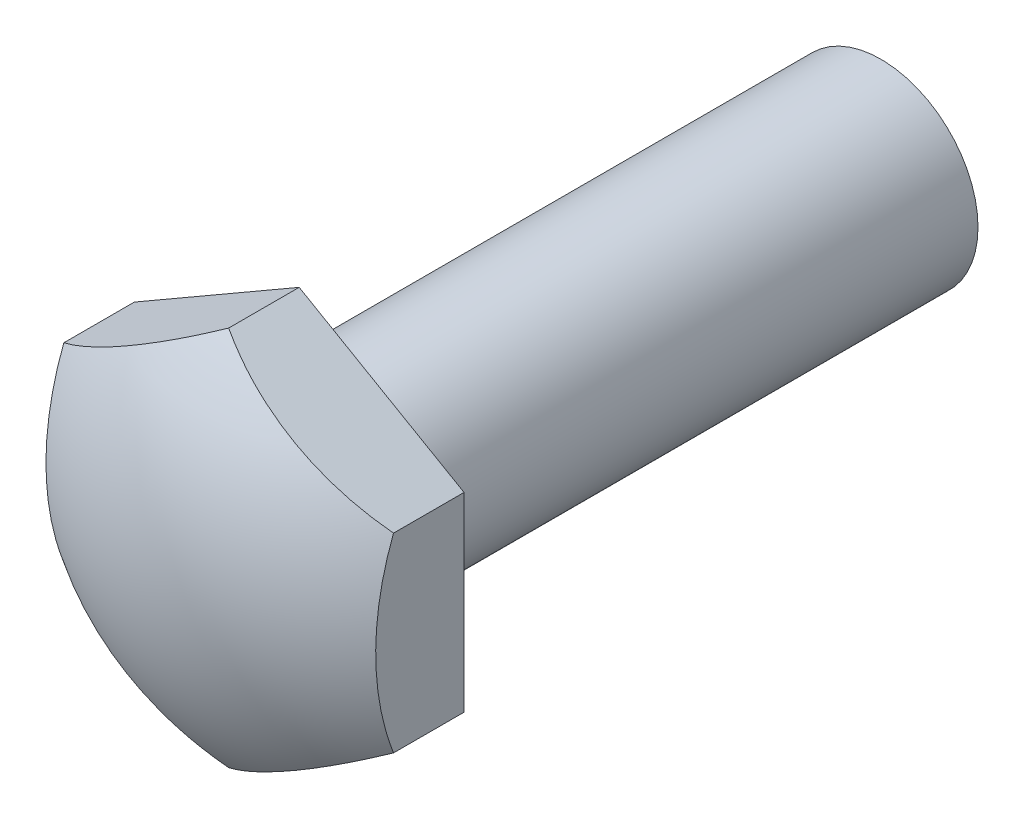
ISO-10303-21;
HEADER;
FILE_DESCRIPTION(('STEP AP214'),'2;1');
FILE_NAME('part.step','',(''),(''),'','','');
FILE_SCHEMA(('AUTOMOTIVE_DESIGN { 1 0 10303 214 1 1 1 1 }'));
ENDSEC;
DATA;
#1=APPLICATION_CONTEXT('core data for automotive mechanical design processes');
#2=APPLICATION_PROTOCOL_DEFINITION('international standard','automotive_design',2000,#1);
#3=PRODUCT_CONTEXT('',#1,'mechanical');
#4=PRODUCT('Part','Part','',(#3));
#5=PRODUCT_RELATED_PRODUCT_CATEGORY('part','',(#4));
#6=PRODUCT_DEFINITION_FORMATION('','',#4);
#7=PRODUCT_DEFINITION_CONTEXT('part definition',#1,'design');
#8=PRODUCT_DEFINITION('design','',#6,#7);
#9=PRODUCT_DEFINITION_SHAPE('','',#8);
#10=(LENGTH_UNIT() NAMED_UNIT(*) SI_UNIT(.MILLI.,.METRE.));
#11=(NAMED_UNIT(*) PLANE_ANGLE_UNIT() SI_UNIT($,.RADIAN.));
#12=(NAMED_UNIT(*) SI_UNIT($,.STERADIAN.) SOLID_ANGLE_UNIT());
#13=UNCERTAINTY_MEASURE_WITH_UNIT(LENGTH_MEASURE(1.E-05),#10,'distance_accuracy_value','');
#14=(GEOMETRIC_REPRESENTATION_CONTEXT(3) GLOBAL_UNCERTAINTY_ASSIGNED_CONTEXT((#13)) GLOBAL_UNIT_ASSIGNED_CONTEXT((#10,
#11,#12)) REPRESENTATION_CONTEXT('',''));
#15=CARTESIAN_POINT('',(0.,0.,0.));
#16=DIRECTION('',(0.,0.,1.));
#17=DIRECTION('',(1.,0.,0.));
#18=AXIS2_PLACEMENT_3D('',#15,#16,#17);
#19=CARTESIAN_POINT('',(0.,0.,-9.));
#20=DIRECTION('',(0.,-1.,0.));
#21=DIRECTION('',(0.,0.,-1.));
#22=AXIS2_PLACEMENT_3D('',#19,#20,#21);
#23=SPHERICAL_SURFACE('',#22,16.);
#24=CARTESIAN_POINT('',(8.5,-4.90747728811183,3.63592761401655));
#25=CARTESIAN_POINT('',(8.29503436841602,-5.02581425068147,3.72785445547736));
#26=CARTESIAN_POINT('',(8.08782796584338,-5.1454449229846,3.8131166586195));
#27=CARTESIAN_POINT('',(7.66959841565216,-5.38690986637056,3.9700758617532));
#28=CARTESIAN_POINT('',(7.45857529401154,-5.508744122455,4.04177295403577));
#29=CARTESIAN_POINT('',(7.03337332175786,-5.75423459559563,4.17136756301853));
#30=CARTESIAN_POINT('',(6.81919445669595,-5.87789082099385,4.22926501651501));
#31=CARTESIAN_POINT('',(6.38806811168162,-6.12680173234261,4.33114861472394));
#32=CARTESIAN_POINT('',(6.17111727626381,-6.252058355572,4.37511582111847));
#33=CARTESIAN_POINT('',(5.73542067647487,-6.50360790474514,4.44889081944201));
#34=CARTESIAN_POINT('',(5.51667496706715,-6.62990079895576,4.47869904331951));
#35=CARTESIAN_POINT('',(5.07810169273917,-6.88311119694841,4.52406404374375));
#36=CARTESIAN_POINT('',(4.85827417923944,-7.01002867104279,4.53962149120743));
#37=CARTESIAN_POINT('',(4.30797766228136,-7.32774251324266,4.56064246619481));
#38=CARTESIAN_POINT('',(3.9772208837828,-7.51870502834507,4.55715181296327));
#39=CARTESIAN_POINT('',(3.31712733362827,-7.8998102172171,4.51796354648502));
#40=CARTESIAN_POINT('',(2.98779073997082,-8.08995278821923,4.48226200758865));
#41=CARTESIAN_POINT('',(2.33368464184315,-8.46760112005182,4.37903559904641));
#42=CARTESIAN_POINT('',(2.00890613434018,-8.65511207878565,4.3115866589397));
#43=CARTESIAN_POINT('',(1.36555876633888,-9.02654885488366,4.14539452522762));
#44=CARTESIAN_POINT('',(1.04698637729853,-9.21047670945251,4.04666969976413));
#45=CARTESIAN_POINT('',(0.609111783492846,-9.46328372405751,3.88788705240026));
#46=CARTESIAN_POINT('',(0.48621526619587,-9.53423806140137,3.84072693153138));
#47=CARTESIAN_POINT('',(0.241960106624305,-9.67525884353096,3.74178641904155));
#48=CARTESIAN_POINT('',(0.120600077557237,-9.7453260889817,3.69001059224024));
#49=CARTESIAN_POINT('',(0.,-9.8149545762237,3.63592761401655));
#50=B_SPLINE_CURVE_WITH_KNOTS('',3,(#24,#25,#26,#27,#28,#29,#30,#31,#32,#33,#34,#35,#36,#37,#38,
#39,#40,#41,#42,#43,#44,#45,#46,#47,#48,#49),.UNSPECIFIED.,.F.,.F.,(4,2,2,2,2,2,2,2,2,2,2,2,4),
(0.,0.761597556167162,1.5231899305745,2.28478579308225,3.04741265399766,3.8100162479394,
4.57258393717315,5.71696615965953,6.8614878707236,8.00328605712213,9.1444149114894,
9.59296979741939,10.0410858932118),.UNSPECIFIED.);
#51=CARTESIAN_POINT('',(8.5,-4.90747728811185,3.63592761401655));
#52=VERTEX_POINT('',#51);
#53=CARTESIAN_POINT('',(0.,-9.81495457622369,3.63592761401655));
#54=VERTEX_POINT('',#53);
#55=EDGE_CURVE('E76',#52,#54,#50,.T.);
#56=ORIENTED_EDGE('',*,*,#55,.F.);
#57=CARTESIAN_POINT('',(8.5,4.90747728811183,3.63592761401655));
#58=CARTESIAN_POINT('',(8.5,4.67080336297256,3.72785445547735));
#59=CARTESIAN_POINT('',(8.5,4.4315420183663,3.8131166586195));
#60=CARTESIAN_POINT('',(8.5,3.94861213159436,3.97007586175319));
#61=CARTESIAN_POINT('',(8.5,3.70494361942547,4.04177295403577));
#62=CARTESIAN_POINT('',(8.5,3.21396267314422,4.17136756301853));
#63=CARTESIAN_POINT('',(8.5,2.96665022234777,4.22926501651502));
#64=CARTESIAN_POINT('',(8.5,2.46882839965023,4.33114861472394));
#65=CARTESIAN_POINT('',(8.5,2.21831515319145,4.37511582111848));
#66=CARTESIAN_POINT('',(8.5,1.71521605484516,4.44889081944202));
#67=CARTESIAN_POINT('',(8.5,1.46263026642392,4.4786990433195));
#68=CARTESIAN_POINT('',(8.5,0.956209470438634,4.52406404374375));
#69=CARTESIAN_POINT('',(8.5,0.702374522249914,4.53962149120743));
#70=CARTESIAN_POINT('',(8.5,0.0669468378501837,4.56064246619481));
#71=CARTESIAN_POINT('',(8.5,-0.314978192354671,4.55715181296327));
#72=CARTESIAN_POINT('',(8.5,-1.07718857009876,4.51796354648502));
#73=CARTESIAN_POINT('',(8.5,-1.45747371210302,4.48226200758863));
#74=CARTESIAN_POINT('',(8.5,-2.21277037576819,4.3790355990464));
#75=CARTESIAN_POINT('',(8.5,-2.58779229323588,4.31158665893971));
#76=CARTESIAN_POINT('',(8.5,-3.33066584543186,4.1453945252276));
#77=CARTESIAN_POINT('',(8.5,-3.69852155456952,4.04666969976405));
#78=CARTESIAN_POINT('',(8.5,-4.20413558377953,3.88788705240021));
#79=CARTESIAN_POINT('',(8.5,-4.34604425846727,3.84072693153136));
#80=CARTESIAN_POINT('',(8.5,-4.62808582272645,3.74178641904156));
#81=CARTESIAN_POINT('',(8.5,-4.76822031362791,3.69001059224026));
#82=CARTESIAN_POINT('',(8.5,-4.90747728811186,3.63592761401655));
#83=B_SPLINE_CURVE_WITH_KNOTS('',3,(#57,#58,#59,#60,#61,#62,#63,#64,#65,#66,#67,#68,#69,#70,#71,
#72,#73,#74,#75,#76,#77,#78,#79,#80,#81,#82),.UNSPECIFIED.,.F.,.F.,(4,2,2,2,2,2,2,2,2,2,2,2,4),
(0.,0.761597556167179,1.52318993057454,2.28478579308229,3.04741265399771,3.81001624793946,
4.5725839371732,5.71696615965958,6.86148787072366,8.00328605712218,9.14441491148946,
9.59296979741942,10.0410858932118),.UNSPECIFIED.);
#84=CARTESIAN_POINT('',(8.5,4.90747728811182,3.63592761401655));
#85=VERTEX_POINT('',#84);
#86=EDGE_CURVE('E18',#85,#52,#83,.T.);
#87=ORIENTED_EDGE('',*,*,#86,.F.);
#88=CARTESIAN_POINT('',(8.5,4.90747728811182,3.63592761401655));
#89=CARTESIAN_POINT('',(8.29503436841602,5.02581425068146,3.72785445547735));
#90=CARTESIAN_POINT('',(8.08782796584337,5.14544492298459,3.81311665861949));
#91=CARTESIAN_POINT('',(7.66959841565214,5.38690986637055,3.97007586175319));
#92=CARTESIAN_POINT('',(7.45857529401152,5.508744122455,4.04177295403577));
#93=CARTESIAN_POINT('',(7.03337332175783,5.75423459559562,4.17136756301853));
#94=CARTESIAN_POINT('',(6.81919445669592,5.87789082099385,4.22926501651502));
#95=CARTESIAN_POINT('',(6.38806811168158,6.12680173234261,4.33114861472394));
#96=CARTESIAN_POINT('',(6.17111727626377,6.252058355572,4.37511582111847));
#97=CARTESIAN_POINT('',(5.73542067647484,6.50360790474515,4.44889081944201));
#98=CARTESIAN_POINT('',(5.51667496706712,6.62990079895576,4.4786990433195));
#99=CARTESIAN_POINT('',(5.07810169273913,6.88311119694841,4.52406404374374));
#100=CARTESIAN_POINT('',(4.8582741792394,7.01002867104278,4.53962149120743));
#101=CARTESIAN_POINT('',(4.30797766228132,7.32774251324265,4.56064246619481));
#102=CARTESIAN_POINT('',(3.97722088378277,7.51870502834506,4.55715181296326));
#103=CARTESIAN_POINT('',(3.31712733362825,7.8998102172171,4.51796354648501));
#104=CARTESIAN_POINT('',(2.9877907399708,8.08995278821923,4.48226200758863));
#105=CARTESIAN_POINT('',(2.33368464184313,8.46760112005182,4.3790355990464));
#106=CARTESIAN_POINT('',(2.00890613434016,8.65511207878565,4.3115866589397));
#107=CARTESIAN_POINT('',(1.36555876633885,9.02654885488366,4.14539452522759));
#108=CARTESIAN_POINT('',(1.04698637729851,9.21047670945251,4.04666969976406));
#109=CARTESIAN_POINT('',(0.609111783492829,9.4632837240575,3.88788705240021));
#110=CARTESIAN_POINT('',(0.486215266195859,9.53423806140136,3.84072693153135));
#111=CARTESIAN_POINT('',(0.241960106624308,9.67525884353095,3.74178641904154));
#112=CARTESIAN_POINT('',(0.120600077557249,9.74532608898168,3.69001059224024));
#113=CARTESIAN_POINT('',(0.,9.81495457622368,3.63592761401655));
#114=B_SPLINE_CURVE_WITH_KNOTS('',3,(#88,#89,#90,#91,#92,#93,#94,#95,#96,#97,#98,#99,#100,#101,
#102,#103,#104,#105,#106,#107,#108,#109,#110,#111,#112,#113),.UNSPECIFIED.,.F.,.F.,(4,2,2,2,2,2,
2,2,2,2,2,2,4),(0.,0.761597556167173,1.52318993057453,2.28478579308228,3.0474126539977,
3.81001624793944,4.57258393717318,5.71696615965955,6.86148787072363,8.00328605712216,
9.14441491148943,9.59296979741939,10.0410858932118),.UNSPECIFIED.);
#115=CARTESIAN_POINT('',(0.,9.81495457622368,3.63592761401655));
#116=VERTEX_POINT('',#115);
#117=EDGE_CURVE('E73',#85,#116,#114,.T.);
#118=ORIENTED_EDGE('',*,*,#117,.T.);
#119=CARTESIAN_POINT('',(-8.5,4.90747728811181,3.63592761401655));
#120=CARTESIAN_POINT('',(-8.29503436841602,5.02581425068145,3.72785445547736));
#121=CARTESIAN_POINT('',(-8.08782796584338,5.14544492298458,3.8131166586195));
#122=CARTESIAN_POINT('',(-7.66959841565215,5.38690986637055,3.97007586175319));
#123=CARTESIAN_POINT('',(-7.45857529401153,5.50874412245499,4.04177295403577));
#124=CARTESIAN_POINT('',(-7.03337332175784,5.75423459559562,4.17136756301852));
#125=CARTESIAN_POINT('',(-6.81919445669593,5.87789082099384,4.22926501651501));
#126=CARTESIAN_POINT('',(-6.3880681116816,6.12680173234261,4.33114861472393));
#127=CARTESIAN_POINT('',(-6.17111727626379,6.25205835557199,4.37511582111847));
#128=CARTESIAN_POINT('',(-5.73542067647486,6.50360790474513,4.44889081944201));
#129=CARTESIAN_POINT('',(-5.51667496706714,6.62990079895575,4.4786990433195));
#130=CARTESIAN_POINT('',(-5.07810169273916,6.8831111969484,4.52406404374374));
#131=CARTESIAN_POINT('',(-4.85827417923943,7.01002867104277,4.53962149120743));
#132=CARTESIAN_POINT('',(-4.30797766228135,7.32774251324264,4.56064246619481));
#133=CARTESIAN_POINT('',(-3.9772208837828,7.51870502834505,4.55715181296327));
#134=CARTESIAN_POINT('',(-3.31712733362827,7.89981021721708,4.51796354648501));
#135=CARTESIAN_POINT('',(-2.98779073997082,8.08995278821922,4.48226200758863));
#136=CARTESIAN_POINT('',(-2.33368464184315,8.4676011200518,4.3790355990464));
#137=CARTESIAN_POINT('',(-2.00890613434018,8.65511207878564,4.3115866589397));
#138=CARTESIAN_POINT('',(-1.36555876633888,9.02654885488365,4.1453945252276));
#139=CARTESIAN_POINT('',(-1.04698637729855,9.2104767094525,4.04666969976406));
#140=CARTESIAN_POINT('',(-0.609111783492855,9.46328372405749,3.88788705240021));
#141=CARTESIAN_POINT('',(-0.486215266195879,9.53423806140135,3.84072693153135));
#142=CARTESIAN_POINT('',(-0.24196010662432,9.67525884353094,3.74178641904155));
#143=CARTESIAN_POINT('',(-0.120600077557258,9.74532608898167,3.69001059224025));
#144=CARTESIAN_POINT('',(0.,9.81495457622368,3.63592761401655));
#145=B_SPLINE_CURVE_WITH_KNOTS('',3,(#119,#120,#121,#122,#123,#124,#125,#126,#127,#128,#129,
#130,#131,#132,#133,#134,#135,#136,#137,#138,#139,#140,#141,#142,#143,#144),.UNSPECIFIED.,.F.,
.F.,(4,2,2,2,2,2,2,2,2,2,2,2,4),(0.,0.761597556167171,1.52318993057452,2.28478579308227,
3.04741265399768,3.81001624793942,4.57258393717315,5.71696615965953,6.8614878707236,
8.00328605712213,9.1444149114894,9.59296979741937,10.0410858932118),.UNSPECIFIED.);
#146=CARTESIAN_POINT('',(-8.5,4.90747728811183,3.6359276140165));
#147=VERTEX_POINT('',#146);
#148=EDGE_CURVE('E92',#147,#116,#145,.T.);
#149=ORIENTED_EDGE('',*,*,#148,.F.);
#150=CARTESIAN_POINT('',(-8.5,4.90747728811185,3.63592761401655));
#151=CARTESIAN_POINT('',(-8.5,4.67080336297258,3.72785445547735));
#152=CARTESIAN_POINT('',(-8.5,4.43154201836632,3.81311665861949));
#153=CARTESIAN_POINT('',(-8.5,3.94861213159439,3.97007586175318));
#154=CARTESIAN_POINT('',(-8.5,3.70494361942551,4.04177295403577));
#155=CARTESIAN_POINT('',(-8.5,3.21396267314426,4.17136756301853));
#156=CARTESIAN_POINT('',(-8.5,2.96665022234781,4.22926501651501));
#157=CARTESIAN_POINT('',(-8.5,2.46882839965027,4.33114861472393));
#158=CARTESIAN_POINT('',(-8.5,2.21831515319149,4.37511582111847));
#159=CARTESIAN_POINT('',(-8.5,1.7152160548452,4.44889081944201));
#160=CARTESIAN_POINT('',(-8.5,1.46263026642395,4.4786990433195));
#161=CARTESIAN_POINT('',(-8.5,0.956209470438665,4.52406404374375));
#162=CARTESIAN_POINT('',(-8.5,0.702374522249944,4.53962149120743));
#163=CARTESIAN_POINT('',(-8.5,0.0669468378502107,4.56064246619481));
#164=CARTESIAN_POINT('',(-8.5,-0.314978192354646,4.55715181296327));
#165=CARTESIAN_POINT('',(-8.5,-1.07718857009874,4.51796354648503));
#166=CARTESIAN_POINT('',(-8.5,-1.45747371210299,4.48226200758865));
#167=CARTESIAN_POINT('',(-8.5,-2.21277037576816,4.3790355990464));
#168=CARTESIAN_POINT('',(-8.5,-2.58779229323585,4.3115866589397));
#169=CARTESIAN_POINT('',(-8.5,-3.33066584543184,4.14539452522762));
#170=CARTESIAN_POINT('',(-8.5,-3.6985215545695,4.04666969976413));
#171=CARTESIAN_POINT('',(-8.5,-4.20413558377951,3.88788705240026));
#172=CARTESIAN_POINT('',(-8.5,-4.34604425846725,3.84072693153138));
#173=CARTESIAN_POINT('',(-8.5,-4.62808582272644,3.74178641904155));
#174=CARTESIAN_POINT('',(-8.5,-4.7682203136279,3.69001059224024));
#175=CARTESIAN_POINT('',(-8.5,-4.90747728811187,3.63592761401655));
#176=B_SPLINE_CURVE_WITH_KNOTS('',3,(#150,#151,#152,#153,#154,#155,#156,#157,#158,#159,#160,
#161,#162,#163,#164,#165,#166,#167,#168,#169,#170,#171,#172,#173,#174,#175),.UNSPECIFIED.,.F.,
.F.,(4,2,2,2,2,2,2,2,2,2,2,2,4),(0.,0.761597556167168,1.52318993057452,2.28478579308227,
3.04741265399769,3.81001624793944,4.57258393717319,5.71696615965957,6.86148787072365,
8.00328605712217,9.14441491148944,9.59296979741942,10.0410858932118),.UNSPECIFIED.);
#177=CARTESIAN_POINT('',(-8.5,-4.90747728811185,3.6359276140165));
#178=VERTEX_POINT('',#177);
#179=EDGE_CURVE('E123',#147,#178,#176,.T.);
#180=ORIENTED_EDGE('',*,*,#179,.T.);
#181=CARTESIAN_POINT('',(-8.5,-4.90747728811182,3.63592761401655));
#182=CARTESIAN_POINT('',(-8.29503436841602,-5.02581425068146,3.72785445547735));
#183=CARTESIAN_POINT('',(-8.08782796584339,-5.1454449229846,3.8131166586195));
#184=CARTESIAN_POINT('',(-7.66959841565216,-5.38690986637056,3.97007586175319));
#185=CARTESIAN_POINT('',(-7.45857529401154,-5.508744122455,4.04177295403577));
#186=CARTESIAN_POINT('',(-7.03337332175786,-5.75423459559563,4.17136756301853));
#187=CARTESIAN_POINT('',(-6.81919445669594,-5.87789082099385,4.22926501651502));
#188=CARTESIAN_POINT('',(-6.3880681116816,-6.12680173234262,4.33114861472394));
#189=CARTESIAN_POINT('',(-6.17111727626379,-6.25205835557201,4.37511582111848));
#190=CARTESIAN_POINT('',(-5.73542067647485,-6.50360790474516,4.44889081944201));
#191=CARTESIAN_POINT('',(-5.51667496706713,-6.62990079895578,4.4786990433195));
#192=CARTESIAN_POINT('',(-5.07810169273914,-6.88311119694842,4.52406404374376));
#193=CARTESIAN_POINT('',(-4.8582741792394,-7.01002867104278,4.53962149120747));
#194=CARTESIAN_POINT('',(-4.30797766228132,-7.32774251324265,4.56064246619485));
#195=CARTESIAN_POINT('',(-3.97722088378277,-7.51870502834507,4.55715181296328));
#196=CARTESIAN_POINT('',(-3.31712733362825,-7.89981021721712,4.51796354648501));
#197=CARTESIAN_POINT('',(-2.9877907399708,-8.08995278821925,4.48226200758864));
#198=CARTESIAN_POINT('',(-2.33368464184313,-8.46760112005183,4.3790355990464));
#199=CARTESIAN_POINT('',(-2.00890613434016,-8.65511207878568,4.31158665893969));
#200=CARTESIAN_POINT('',(-1.36555876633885,-9.02654885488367,4.14539452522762));
#201=CARTESIAN_POINT('',(-1.04698637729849,-9.21047670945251,4.04666969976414));
#202=CARTESIAN_POINT('',(-0.609111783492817,-9.46328372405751,3.88788705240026));
#203=CARTESIAN_POINT('',(-0.486215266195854,-9.53423806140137,3.84072693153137));
#204=CARTESIAN_POINT('',(-0.241960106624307,-9.67525884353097,3.74178641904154));
#205=CARTESIAN_POINT('',(-0.120600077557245,-9.7453260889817,3.69001059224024));
#206=CARTESIAN_POINT('',(0.,-9.81495457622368,3.63592761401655));
#207=B_SPLINE_CURVE_WITH_KNOTS('',3,(#181,#182,#183,#184,#185,#186,#187,#188,#189,#190,#191,
#192,#193,#194,#195,#196,#197,#198,#199,#200,#201,#202,#203,#204,#205,#206),.UNSPECIFIED.,.F.,
.F.,(4,2,2,2,2,2,2,2,2,2,2,2,4),(0.,0.761597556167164,1.52318993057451,2.28478579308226,
3.04741265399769,3.81001624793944,4.57258393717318,5.71696615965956,6.86148787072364,
8.00328605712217,9.14441491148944,9.59296979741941,10.0410858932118),.UNSPECIFIED.);
#208=EDGE_CURVE('E129',#178,#54,#207,.T.);
#209=ORIENTED_EDGE('',*,*,#208,.T.);
#210=EDGE_LOOP('',(#56,#87,#118,#149,#180,#209));
#211=FACE_BOUND('',#210,.T.);
#212=ADVANCED_FACE('F14',(#211),#23,.T.);
#213=CARTESIAN_POINT('',(8.5,4.90747728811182,8.));
#214=DIRECTION('',(1.,0.,0.));
#215=DIRECTION('',(0.,0.,-1.));
#216=AXIS2_PLACEMENT_3D('',#213,#214,#215);
#217=PLANE('',#216);
#218=DIRECTION('',(0.,1.,0.));
#219=VECTOR('',#218,1.);
#220=CARTESIAN_POINT('',(8.5,0.,0.));
#221=LINE('',#220,#219);
#222=CARTESIAN_POINT('',(8.5,-4.90747728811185,0.));
#223=VERTEX_POINT('',#222);
#224=CARTESIAN_POINT('',(8.5,4.90747728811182,0.));
#225=VERTEX_POINT('',#224);
#226=EDGE_CURVE('E84',#223,#225,#221,.T.);
#227=ORIENTED_EDGE('',*,*,#226,.T.);
#228=DIRECTION('',(0.,0.,1.));
#229=VECTOR('',#228,1.);
#230=CARTESIAN_POINT('',(8.5,4.90747728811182,8.));
#231=LINE('',#230,#229);
#232=EDGE_CURVE('E80',#225,#85,#231,.T.);
#233=ORIENTED_EDGE('',*,*,#232,.T.);
#234=ORIENTED_EDGE('',*,*,#86,.T.);
#235=DIRECTION('',(0.,0.,1.));
#236=VECTOR('',#235,1.);
#237=CARTESIAN_POINT('',(8.5,-4.90747728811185,8.));
#238=LINE('',#237,#236);
#239=EDGE_CURVE('E132',#223,#52,#238,.T.);
#240=ORIENTED_EDGE('',*,*,#239,.F.);
#241=EDGE_LOOP('',(#227,#233,#234,#240));
#242=FACE_BOUND('',#241,.T.);
#243=ADVANCED_FACE('F82',(#242),#217,.T.);
#244=CARTESIAN_POINT('',(8.5,4.90747728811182,8.));
#245=DIRECTION('',(-0.5,-0.866025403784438,0.));
#246=DIRECTION('',(0.866025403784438,-0.5,0.));
#247=AXIS2_PLACEMENT_3D('',#244,#245,#246);
#248=PLANE('',#247);
#249=ORIENTED_EDGE('',*,*,#117,.F.);
#250=ORIENTED_EDGE('',*,*,#232,.F.);
#251=DIRECTION('',(-0.866025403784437,0.5,0.));
#252=VECTOR('',#251,1.);
#253=CARTESIAN_POINT('',(8.5,4.90747728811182,0.));
#254=LINE('',#253,#252);
#255=CARTESIAN_POINT('',(0.,9.81495457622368,0.));
#256=VERTEX_POINT('',#255);
#257=EDGE_CURVE('E146',#225,#256,#254,.T.);
#258=ORIENTED_EDGE('',*,*,#257,.T.);
#259=DIRECTION('',(0.,0.,1.));
#260=VECTOR('',#259,1.);
#261=CARTESIAN_POINT('',(0.,9.81495457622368,8.));
#262=LINE('',#261,#260);
#263=EDGE_CURVE('E90',#116,#256,#262,.F.);
#264=ORIENTED_EDGE('',*,*,#263,.F.);
#265=EDGE_LOOP('',(#249,#250,#258,#264));
#266=FACE_BOUND('',#265,.T.);
#267=ADVANCED_FACE('F88',(#266),#248,.F.);
#268=CARTESIAN_POINT('',(-8.5,4.90747728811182,8.));
#269=DIRECTION('',(-0.5,0.866025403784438,0.));
#270=DIRECTION('',(-0.866025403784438,-0.5,0.));
#271=AXIS2_PLACEMENT_3D('',#268,#269,#270);
#272=PLANE('',#271);
#273=DIRECTION('',(-0.866025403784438,-0.5,0.));
#274=VECTOR('',#273,1.);
#275=CARTESIAN_POINT('',(0.,9.81495457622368,0.));
#276=LINE('',#275,#274);
#277=CARTESIAN_POINT('',(-8.5,4.90747728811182,0.));
#278=VERTEX_POINT('',#277);
#279=EDGE_CURVE('E154',#256,#278,#276,.T.);
#280=ORIENTED_EDGE('',*,*,#279,.T.);
#281=DIRECTION('',(0.,0.,-1.));
#282=VECTOR('',#281,1.);
#283=CARTESIAN_POINT('',(-8.5,4.90747728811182,8.));
#284=LINE('',#283,#282);
#285=EDGE_CURVE('E118',#278,#147,#284,.F.);
#286=ORIENTED_EDGE('',*,*,#285,.T.);
#287=ORIENTED_EDGE('',*,*,#148,.T.);
#288=ORIENTED_EDGE('',*,*,#263,.T.);
#289=EDGE_LOOP('',(#280,#286,#287,#288));
#290=FACE_BOUND('',#289,.T.);
#291=ADVANCED_FACE('F207',(#290),#272,.T.);
#292=CARTESIAN_POINT('',(-8.5,4.90747728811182,8.));
#293=DIRECTION('',(1.,0.,0.));
#294=DIRECTION('',(0.,0.,-1.));
#295=AXIS2_PLACEMENT_3D('',#292,#293,#294);
#296=PLANE('',#295);
#297=ORIENTED_EDGE('',*,*,#179,.F.);
#298=ORIENTED_EDGE('',*,*,#285,.F.);
#299=DIRECTION('',(0.,1.,0.));
#300=VECTOR('',#299,1.);
#301=CARTESIAN_POINT('',(-8.5,0.,0.));
#302=LINE('',#301,#300);
#303=CARTESIAN_POINT('',(-8.5,-4.90747728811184,0.));
#304=VERTEX_POINT('',#303);
#305=EDGE_CURVE('E150',#278,#304,#302,.F.);
#306=ORIENTED_EDGE('',*,*,#305,.T.);
#307=DIRECTION('',(0.,0.,1.));
#308=VECTOR('',#307,1.);
#309=CARTESIAN_POINT('',(-8.5,-4.90747728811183,8.));
#310=LINE('',#309,#308);
#311=EDGE_CURVE('E126',#304,#178,#310,.T.);
#312=ORIENTED_EDGE('',*,*,#311,.T.);
#313=EDGE_LOOP('',(#297,#298,#306,#312));
#314=FACE_BOUND('',#313,.T.);
#315=ADVANCED_FACE('F205',(#314),#296,.F.);
#316=CARTESIAN_POINT('',(-8.5,-4.90747728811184,8.));
#317=DIRECTION('',(0.5,0.866025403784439,0.));
#318=DIRECTION('',(-0.866025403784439,0.5,0.));
#319=AXIS2_PLACEMENT_3D('',#316,#317,#318);
#320=PLANE('',#319);
#321=ORIENTED_EDGE('',*,*,#208,.F.);
#322=ORIENTED_EDGE('',*,*,#311,.F.);
#323=DIRECTION('',(0.866025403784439,-0.5,0.));
#324=VECTOR('',#323,1.);
#325=CARTESIAN_POINT('',(-8.5,-4.90747728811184,0.));
#326=LINE('',#325,#324);
#327=CARTESIAN_POINT('',(0.,-9.81495457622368,0.));
#328=VERTEX_POINT('',#327);
#329=EDGE_CURVE('E39',#304,#328,#326,.T.);
#330=ORIENTED_EDGE('',*,*,#329,.T.);
#331=DIRECTION('',(0.,0.,1.));
#332=VECTOR('',#331,1.);
#333=CARTESIAN_POINT('',(0.,-9.8149545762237,8.));
#334=LINE('',#333,#332);
#335=EDGE_CURVE('E134',#54,#328,#334,.F.);
#336=ORIENTED_EDGE('',*,*,#335,.F.);
#337=EDGE_LOOP('',(#321,#322,#330,#336));
#338=FACE_BOUND('',#337,.T.);
#339=ADVANCED_FACE('F180',(#338),#320,.F.);
#340=CARTESIAN_POINT('',(8.5,-4.90747728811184,8.));
#341=DIRECTION('',(0.5,-0.866025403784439,0.));
#342=DIRECTION('',(0.866025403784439,0.5,0.));
#343=AXIS2_PLACEMENT_3D('',#340,#341,#342);
#344=PLANE('',#343);
#345=DIRECTION('',(0.86602540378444,0.5,0.));
#346=VECTOR('',#345,1.);
#347=CARTESIAN_POINT('',(0.,-9.81495457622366,0.));
#348=LINE('',#347,#346);
#349=EDGE_CURVE('E140',#328,#223,#348,.T.);
#350=ORIENTED_EDGE('',*,*,#349,.T.);
#351=ORIENTED_EDGE('',*,*,#239,.T.);
#352=ORIENTED_EDGE('',*,*,#55,.T.);
#353=ORIENTED_EDGE('',*,*,#335,.T.);
#354=EDGE_LOOP('',(#350,#351,#352,#353));
#355=FACE_BOUND('',#354,.T.);
#356=ADVANCED_FACE('F175',(#355),#344,.T.);
#357=CARTESIAN_POINT('',(0.,0.,-30.));
#358=DIRECTION('',(0.,0.,-1.));
#359=DIRECTION('',(-1.,0.,0.));
#360=AXIS2_PLACEMENT_3D('',#357,#358,#359);
#361=PLANE('',#360);
#362=CARTESIAN_POINT('',(0.,0.,-30.));
#363=DIRECTION('',(0.,0.,1.));
#364=DIRECTION('',(1.,0.,0.));
#365=AXIS2_PLACEMENT_3D('',#362,#363,#364);
#366=CIRCLE('',#365,5.);
#367=CARTESIAN_POINT('',(5.,0.,-30.));
#368=VERTEX_POINT('',#367);
#369=EDGE_CURVE('E30',#368,#368,#366,.T.);
#370=ORIENTED_EDGE('',*,*,#369,.F.);
#371=EDGE_LOOP('',(#370));
#372=FACE_BOUND('',#371,.T.);
#373=ADVANCED_FACE('F179',(#372),#361,.T.);
#374=CARTESIAN_POINT('',(5.,0.,0.));
#375=DIRECTION('',(0.,0.,1.));
#376=DIRECTION('',(1.,0.,0.));
#377=AXIS2_PLACEMENT_3D('',#374,#375,#376);
#378=PLANE('',#377);
#379=ORIENTED_EDGE('',*,*,#329,.F.);
#380=ORIENTED_EDGE('',*,*,#305,.F.);
#381=ORIENTED_EDGE('',*,*,#279,.F.);
#382=ORIENTED_EDGE('',*,*,#257,.F.);
#383=ORIENTED_EDGE('',*,*,#226,.F.);
#384=ORIENTED_EDGE('',*,*,#349,.F.);
#385=EDGE_LOOP('',(#379,#380,#381,#382,#383,#384));
#386=FACE_BOUND('',#385,.T.);
#387=CARTESIAN_POINT('',(0.,0.,0.));
#388=DIRECTION('',(0.,0.,1.));
#389=DIRECTION('',(1.,0.,0.));
#390=AXIS2_PLACEMENT_3D('',#387,#388,#389);
#391=CIRCLE('',#390,5.);
#392=CARTESIAN_POINT('',(5.,0.,0.));
#393=VERTEX_POINT('',#392);
#394=EDGE_CURVE('E9',#393,#393,#391,.F.);
#395=ORIENTED_EDGE('',*,*,#394,.F.);
#396=EDGE_LOOP('',(#395));
#397=FACE_BOUND('',#396,.T.);
#398=ADVANCED_FACE('F185',(#386,#397),#378,.F.);
#399=CARTESIAN_POINT('',(0.,0.,20.));
#400=DIRECTION('',(0.,0.,1.));
#401=DIRECTION('',(1.,0.,0.));
#402=AXIS2_PLACEMENT_3D('',#399,#400,#401);
#403=CYLINDRICAL_SURFACE('',#402,5.);
#404=ORIENTED_EDGE('',*,*,#369,.T.);
#405=EDGE_LOOP('',(#404));
#406=FACE_BOUND('',#405,.T.);
#407=ORIENTED_EDGE('',*,*,#394,.T.);
#408=EDGE_LOOP('',(#407));
#409=FACE_BOUND('',#408,.T.);
#410=ADVANCED_FACE('F16',(#406,#409),#403,.T.);
#411=CLOSED_SHELL('',(#212,#243,#267,#291,#315,#339,#356,#373,#398,#410));
#412=MANIFOLD_SOLID_BREP('B1',#411);
#413=ADVANCED_BREP_SHAPE_REPRESENTATION('',(#18,#412),#14);
#414=SHAPE_DEFINITION_REPRESENTATION(#9,#413);
ENDSEC;
END-ISO-10303-21;
